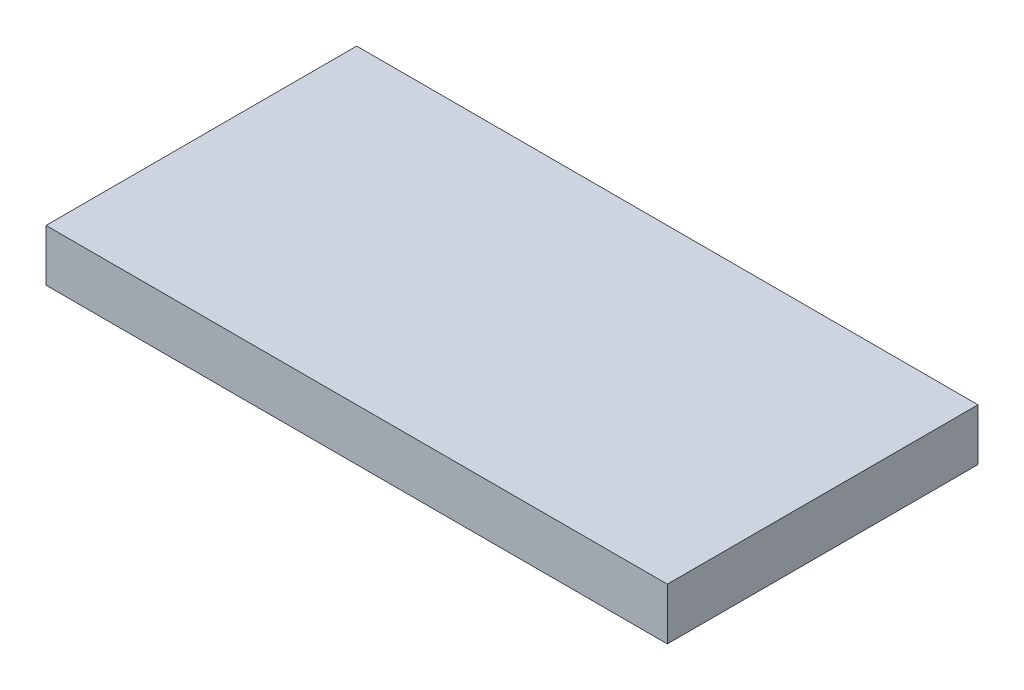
from build123d import *

# Parameters (mm, degrees)
SKETCH1_W      = 152.4
SKETCH1_H      = 76.2
EXTRUDE1_DEPTH = 12.7


with BuildPart() as part:
    # Sketch1 → Extrude1 (new body)
    with BuildSketch(Plane(origin=(0, 0, 0), x_dir=(1, 0, 0), z_dir=(0, 1, 0))):
        with Locations((76.2, 38.1)):
            Rectangle(SKETCH1_W, SKETCH1_H)
    extrude(amount=EXTRUDE1_DEPTH)


solid = part.part
